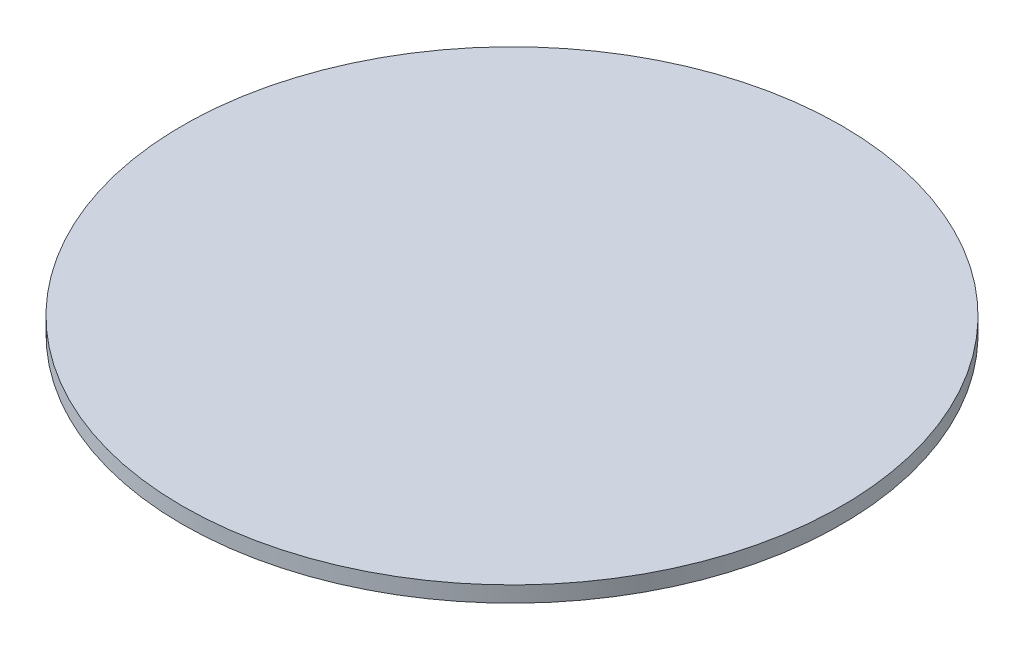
from build123d import *

# Parameters (mm, degrees)
SKETCH1_R           = 25.8953
BOSS_EXTRUDE1_DEPTH = 1.2446


with BuildPart() as part:
    # Sketch1 → Boss-Extrude1 (new body)
    with BuildSketch(Plane(origin=(0, 0, 0), x_dir=(1, 0, 0), z_dir=(0, 1, 0))):
        with Locations(Location((0, 0, 0), (0, 0, 270))):
            Circle(SKETCH1_R)
    extrude(amount=BOSS_EXTRUDE1_DEPTH)


solid = part.part
